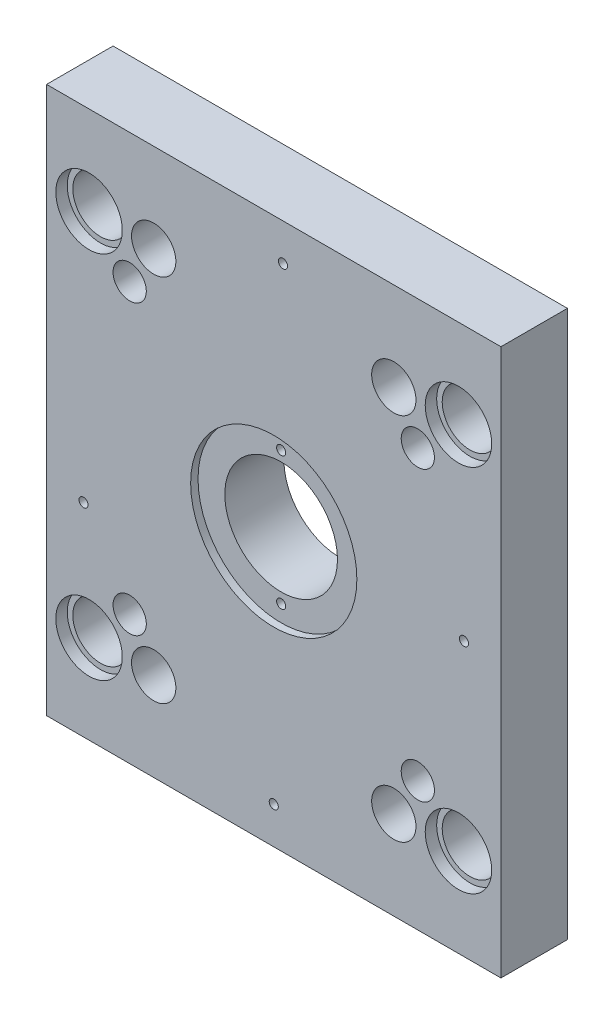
ISO-10303-21;
HEADER;
FILE_DESCRIPTION(('STEP AP214'),'2;1');
FILE_NAME('part.step','',(''),(''),'','','');
FILE_SCHEMA(('AUTOMOTIVE_DESIGN { 1 0 10303 214 1 1 1 1 }'));
ENDSEC;
DATA;
#1=APPLICATION_CONTEXT('core data for automotive mechanical design processes');
#2=APPLICATION_PROTOCOL_DEFINITION('international standard','automotive_design',2000,#1);
#3=PRODUCT_CONTEXT('',#1,'mechanical');
#4=PRODUCT('Part','Part','',(#3));
#5=PRODUCT_RELATED_PRODUCT_CATEGORY('part','',(#4));
#6=PRODUCT_DEFINITION_FORMATION('','',#4);
#7=PRODUCT_DEFINITION_CONTEXT('part definition',#1,'design');
#8=PRODUCT_DEFINITION('design','',#6,#7);
#9=PRODUCT_DEFINITION_SHAPE('','',#8);
#10=(LENGTH_UNIT() NAMED_UNIT(*) SI_UNIT(.MILLI.,.METRE.));
#11=(NAMED_UNIT(*) PLANE_ANGLE_UNIT() SI_UNIT($,.RADIAN.));
#12=(NAMED_UNIT(*) SI_UNIT($,.STERADIAN.) SOLID_ANGLE_UNIT());
#13=UNCERTAINTY_MEASURE_WITH_UNIT(LENGTH_MEASURE(1.E-05),#10,'distance_accuracy_value','');
#14=(GEOMETRIC_REPRESENTATION_CONTEXT(3) GLOBAL_UNCERTAINTY_ASSIGNED_CONTEXT((#13)) GLOBAL_UNIT_ASSIGNED_CONTEXT((#10,
#11,#12)) REPRESENTATION_CONTEXT('',''));
#15=CARTESIAN_POINT('',(0.,0.,0.));
#16=DIRECTION('',(0.,0.,1.));
#17=DIRECTION('',(1.,0.,0.));
#18=AXIS2_PLACEMENT_3D('',#15,#16,#17);
#19=CARTESIAN_POINT('',(0.,-36.,11.0000000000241));
#20=DIRECTION('',(0.,0.,1.));
#21=DIRECTION('',(1.,0.,0.));
#22=AXIS2_PLACEMENT_3D('',#19,#20,#21);
#23=CONICAL_SURFACE('',#22,2.45850000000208,1.04719755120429);
#24=CARTESIAN_POINT('',(0.,-36.,11.));
#25=DIRECTION('',(0.,0.,-1.));
#26=DIRECTION('',(-1.,0.,0.));
#27=AXIS2_PLACEMENT_3D('',#24,#25,#26);
#28=CIRCLE('',#27,2.4585);
#29=CARTESIAN_POINT('',(-2.45849999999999,-36.,11.));
#30=VERTEX_POINT('',#29);
#31=EDGE_CURVE('E180',#30,#30,#28,.F.);
#32=ORIENTED_EDGE('',*,*,#31,.T.);
#33=EDGE_LOOP('',(#32));
#34=FACE_BOUND('',#33,.T.);
#35=CARTESIAN_POINT('',(0.,-36.,9.58058436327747));
#36=VERTEX_POINT('',#35);
#37=VERTEX_LOOP('',#36);
#38=FACE_BOUND('',#37,.T.);
#39=ADVANCED_FACE('F16',(#34,#38),#23,.F.);
#40=CARTESIAN_POINT('',(0.,36.,11.0000000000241));
#41=DIRECTION('',(0.,0.,1.));
#42=DIRECTION('',(1.,0.,0.));
#43=AXIS2_PLACEMENT_3D('',#40,#41,#42);
#44=CONICAL_SURFACE('',#43,2.45850000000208,1.04719755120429);
#45=CARTESIAN_POINT('',(0.,36.,11.));
#46=DIRECTION('',(0.,0.,-1.));
#47=DIRECTION('',(-1.,0.,0.));
#48=AXIS2_PLACEMENT_3D('',#45,#46,#47);
#49=CIRCLE('',#48,2.4585);
#50=CARTESIAN_POINT('',(-2.4585,36.,11.));
#51=VERTEX_POINT('',#50);
#52=EDGE_CURVE('E177',#51,#51,#49,.F.);
#53=ORIENTED_EDGE('',*,*,#52,.T.);
#54=EDGE_LOOP('',(#53));
#55=FACE_BOUND('',#54,.T.);
#56=CARTESIAN_POINT('',(0.,36.0000000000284,9.58058436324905));
#57=VERTEX_POINT('',#56);
#58=VERTEX_LOOP('',#57);
#59=FACE_BOUND('',#58,.T.);
#60=ADVANCED_FACE('F70',(#55,#59),#44,.F.);
#61=CARTESIAN_POINT('',(5.,128.,7.99999999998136));
#62=DIRECTION('',(0.,0.,1.));
#63=DIRECTION('',(1.,0.,0.));
#64=AXIS2_PLACEMENT_3D('',#61,#62,#63);
#65=CONICAL_SURFACE('',#64,2.45849999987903,1.04719755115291);
#66=CARTESIAN_POINT('',(5.,128.,8.00000000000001));
#67=DIRECTION('',(0.,0.,-1.));
#68=DIRECTION('',(-1.,0.,0.));
#69=AXIS2_PLACEMENT_3D('',#66,#67,#68);
#70=CIRCLE('',#69,2.4585);
#71=CARTESIAN_POINT('',(2.5415,128.,8.00000000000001));
#72=VERTEX_POINT('',#71);
#73=EDGE_CURVE('E174',#72,#72,#70,.F.);
#74=ORIENTED_EDGE('',*,*,#73,.T.);
#75=EDGE_LOOP('',(#74));
#76=FACE_BOUND('',#75,.T.);
#77=CARTESIAN_POINT('',(4.99999999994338,128.000000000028,6.5805843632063));
#78=VERTEX_POINT('',#77);
#79=VERTEX_LOOP('',#78);
#80=FACE_BOUND('',#79,.T.);
#81=ADVANCED_FACE('F77',(#76,#80),#65,.F.);
#82=CARTESIAN_POINT('',(102.999999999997,1.46371630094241E-11,7.99999999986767));
#83=DIRECTION('',(0.,0.,1.));
#84=DIRECTION('',(1.,0.,0.));
#85=AXIS2_PLACEMENT_3D('',#82,#83,#84);
#86=CONICAL_SURFACE('',#85,2.45849999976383,1.04719755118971);
#87=CARTESIAN_POINT('',(102.999999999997,1.46371803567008E-11,8.00000000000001));
#88=DIRECTION('',(0.,0.,-1.));
#89=DIRECTION('',(-1.,0.,0.));
#90=AXIS2_PLACEMENT_3D('',#87,#88,#89);
#91=CIRCLE('',#90,2.4585);
#92=CARTESIAN_POINT('',(100.541499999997,1.46371803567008E-11,8.00000000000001));
#93=VERTEX_POINT('',#92);
#94=EDGE_CURVE('E171',#93,#93,#91,.F.);
#95=ORIENTED_EDGE('',*,*,#94,.T.);
#96=EDGE_LOOP('',(#95));
#97=FACE_BOUND('',#96,.T.);
#98=CARTESIAN_POINT('',(102.999999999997,1.46371666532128E-11,6.58058436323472));
#99=VERTEX_POINT('',#98);
#100=VERTEX_LOOP('',#99);
#101=FACE_BOUND('',#100,.T.);
#102=ADVANCED_FACE('F735',(#97,#101),#86,.F.);
#103=CARTESIAN_POINT('',(4.65317888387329E-12,-128.,7.99999999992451));
#104=DIRECTION('',(0.,0.,1.));
#105=DIRECTION('',(1.,0.,0.));
#106=AXIS2_PLACEMENT_3D('',#103,#104,#105);
#107=CONICAL_SURFACE('',#106,2.45849999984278,1.04719755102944);
#108=CARTESIAN_POINT('',(4.6531667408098E-12,-128.,8.00000000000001));
#109=DIRECTION('',(0.,0.,-1.));
#110=DIRECTION('',(-1.,0.,0.));
#111=AXIS2_PLACEMENT_3D('',#108,#109,#110);
#112=CIRCLE('',#111,2.4585);
#113=CARTESIAN_POINT('',(-2.45849999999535,-128.,8.00000000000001));
#114=VERTEX_POINT('',#113);
#115=EDGE_CURVE('E168',#114,#114,#112,.F.);
#116=ORIENTED_EDGE('',*,*,#115,.T.);
#117=EDGE_LOOP('',(#116));
#118=FACE_BOUND('',#117,.T.);
#119=CARTESIAN_POINT('',(-8.0611943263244E-11,-127.999999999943,6.58058436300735));
#120=VERTEX_POINT('',#119);
#121=VERTEX_LOOP('',#120);
#122=FACE_BOUND('',#121,.T.);
#123=ADVANCED_FACE('F727',(#118,#122),#107,.F.);
#124=CARTESIAN_POINT('',(-103.000000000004,-38.,7.99999999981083));
#125=DIRECTION('',(0.,0.,1.));
#126=DIRECTION('',(1.,0.,0.));
#127=AXIS2_PLACEMENT_3D('',#124,#125,#126);
#128=CONICAL_SURFACE('',#127,2.45849999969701,1.047197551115);
#129=CARTESIAN_POINT('',(-103.000000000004,-38.,7.99999999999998));
#130=DIRECTION('',(0.,0.,-1.));
#131=DIRECTION('',(-1.,0.,0.));
#132=AXIS2_PLACEMENT_3D('',#129,#130,#131);
#133=CIRCLE('',#132,2.4585);
#134=CARTESIAN_POINT('',(-105.458500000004,-38.,7.99999999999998));
#135=VERTEX_POINT('',#134);
#136=EDGE_CURVE('E165',#135,#135,#133,.F.);
#137=ORIENTED_EDGE('',*,*,#136,.T.);
#138=EDGE_LOOP('',(#137));
#139=FACE_BOUND('',#138,.T.);
#140=CARTESIAN_POINT('',(-103.00000000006,-37.9999999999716,6.58058436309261));
#141=VERTEX_POINT('',#140);
#142=VERTEX_LOOP('',#141);
#143=FACE_BOUND('',#142,.T.);
#144=ADVANCED_FACE('F719',(#139,#143),#128,.F.);
#145=CARTESIAN_POINT('',(-80.0000000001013,0.,18.));
#146=DIRECTION('',(-1.,0.,0.));
#147=DIRECTION('',(0.,0.,1.));
#148=AXIS2_PLACEMENT_3D('',#145,#146,#147);
#149=CONICAL_SURFACE('',#148,5.9175000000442,1.04719755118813);
#150=CARTESIAN_POINT('',(-80.0000000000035,0.,18.));
#151=DIRECTION('',(1.,0.,0.));
#152=DIRECTION('',(0.,0.,-1.));
#153=AXIS2_PLACEMENT_3D('',#150,#151,#152);
#154=CIRCLE('',#153,5.9175);
#155=CARTESIAN_POINT('',(-80.0000000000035,0.,12.0825));
#156=VERTEX_POINT('',#155);
#157=EDGE_CURVE('E162',#156,#156,#154,.F.);
#158=ORIENTED_EDGE('',*,*,#157,.T.);
#159=EDGE_LOOP('',(#158));
#160=FACE_BOUND('',#159,.T.);
#161=CARTESIAN_POINT('',(-76.5835297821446,5.68434091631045E-11,18.0000000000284));
#162=VERTEX_POINT('',#161);
#163=VERTEX_LOOP('',#162);
#164=FACE_BOUND('',#163,.T.);
#165=ADVANCED_FACE('F712',(#160,#164),#149,.F.);
#166=CARTESIAN_POINT('',(0.,-36.,31.9));
#167=DIRECTION('',(0.,0.,-1.));
#168=DIRECTION('',(-1.,0.,0.));
#169=AXIS2_PLACEMENT_3D('',#166,#167,#168);
#170=CYLINDRICAL_SURFACE('',#169,2.4585);
#171=ORIENTED_EDGE('',*,*,#31,.F.);
#172=EDGE_LOOP('',(#171));
#173=FACE_BOUND('',#172,.T.);
#174=CARTESIAN_POINT('',(0.,-36.,32.));
#175=DIRECTION('',(0.,0.,-1.));
#176=DIRECTION('',(-1.,0.,0.));
#177=AXIS2_PLACEMENT_3D('',#174,#175,#176);
#178=CIRCLE('',#177,2.4585);
#179=CARTESIAN_POINT('',(-2.45849999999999,-36.,32.));
#180=VERTEX_POINT('',#179);
#181=EDGE_CURVE('E288',#180,#180,#178,.T.);
#182=ORIENTED_EDGE('',*,*,#181,.F.);
#183=EDGE_LOOP('',(#182));
#184=FACE_BOUND('',#183,.T.);
#185=ADVANCED_FACE('F493',(#173,#184),#170,.F.);
#186=CARTESIAN_POINT('',(0.,36.,31.9));
#187=DIRECTION('',(0.,0.,-1.));
#188=DIRECTION('',(-1.,0.,0.));
#189=AXIS2_PLACEMENT_3D('',#186,#187,#188);
#190=CYLINDRICAL_SURFACE('',#189,2.4585);
#191=ORIENTED_EDGE('',*,*,#52,.F.);
#192=EDGE_LOOP('',(#191));
#193=FACE_BOUND('',#192,.T.);
#194=CARTESIAN_POINT('',(0.,36.,32.));
#195=DIRECTION('',(0.,0.,-1.));
#196=DIRECTION('',(-1.,0.,0.));
#197=AXIS2_PLACEMENT_3D('',#194,#195,#196);
#198=CIRCLE('',#197,2.4585);
#199=CARTESIAN_POINT('',(-2.4585,36.,32.));
#200=VERTEX_POINT('',#199);
#201=EDGE_CURVE('E285',#200,#200,#198,.T.);
#202=ORIENTED_EDGE('',*,*,#201,.F.);
#203=EDGE_LOOP('',(#202));
#204=FACE_BOUND('',#203,.T.);
#205=ADVANCED_FACE('F484',(#193,#204),#190,.F.);
#206=CARTESIAN_POINT('',(5.,128.,35.9));
#207=DIRECTION('',(0.,0.,-1.));
#208=DIRECTION('',(-1.,0.,0.));
#209=AXIS2_PLACEMENT_3D('',#206,#207,#208);
#210=CYLINDRICAL_SURFACE('',#209,2.4585);
#211=ORIENTED_EDGE('',*,*,#73,.F.);
#212=EDGE_LOOP('',(#211));
#213=FACE_BOUND('',#212,.T.);
#214=CARTESIAN_POINT('',(5.,128.,36.));
#215=DIRECTION('',(0.,0.,-1.));
#216=DIRECTION('',(-1.,0.,0.));
#217=AXIS2_PLACEMENT_3D('',#214,#215,#216);
#218=CIRCLE('',#217,2.4585);
#219=CARTESIAN_POINT('',(2.5415,128.,36.));
#220=VERTEX_POINT('',#219);
#221=EDGE_CURVE('E282',#220,#220,#218,.T.);
#222=ORIENTED_EDGE('',*,*,#221,.F.);
#223=EDGE_LOOP('',(#222));
#224=FACE_BOUND('',#223,.T.);
#225=ADVANCED_FACE('F482',(#213,#224),#210,.F.);
#226=CARTESIAN_POINT('',(100.,-100.,35.9));
#227=DIRECTION('',(0.,0.,-1.));
#228=DIRECTION('',(-1.,0.,0.));
#229=AXIS2_PLACEMENT_3D('',#226,#227,#228);
#230=CYLINDRICAL_SURFACE('',#229,18.);
#231=CARTESIAN_POINT('',(99.9999999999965,-100.,29.8));
#232=DIRECTION('',(0.,0.,-1.));
#233=DIRECTION('',(-1.,0.,0.));
#234=AXIS2_PLACEMENT_3D('',#231,#232,#233);
#235=CIRCLE('',#234,18.);
#236=CARTESIAN_POINT('',(81.9999999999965,-100.,29.8));
#237=VERTEX_POINT('',#236);
#238=EDGE_CURVE('E20',#237,#237,#235,.T.);
#239=ORIENTED_EDGE('',*,*,#238,.T.);
#240=EDGE_LOOP('',(#239));
#241=FACE_BOUND('',#240,.T.);
#242=CARTESIAN_POINT('',(100.,-100.,36.));
#243=DIRECTION('',(0.,0.,-1.));
#244=DIRECTION('',(-1.,0.,0.));
#245=AXIS2_PLACEMENT_3D('',#242,#243,#244);
#246=CIRCLE('',#245,18.);
#247=CARTESIAN_POINT('',(82.,-100.,36.));
#248=VERTEX_POINT('',#247);
#249=EDGE_CURVE('E279',#248,#248,#246,.T.);
#250=ORIENTED_EDGE('',*,*,#249,.F.);
#251=EDGE_LOOP('',(#250));
#252=FACE_BOUND('',#251,.T.);
#253=ADVANCED_FACE('F309',(#241,#252),#230,.F.);
#254=CARTESIAN_POINT('',(65.,100.,35.9));
#255=DIRECTION('',(0.,0.,-1.));
#256=DIRECTION('',(-1.,0.,0.));
#257=AXIS2_PLACEMENT_3D('',#254,#255,#256);
#258=CYLINDRICAL_SURFACE('',#257,12.);
#259=CARTESIAN_POINT('',(64.9999999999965,100.,15.));
#260=DIRECTION('',(0.,0.,-1.));
#261=DIRECTION('',(-1.,0.,0.));
#262=AXIS2_PLACEMENT_3D('',#259,#260,#261);
#263=CIRCLE('',#262,12.);
#264=CARTESIAN_POINT('',(52.9999999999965,100.,15.));
#265=VERTEX_POINT('',#264);
#266=EDGE_CURVE('E302',#265,#265,#263,.T.);
#267=ORIENTED_EDGE('',*,*,#266,.T.);
#268=EDGE_LOOP('',(#267));
#269=FACE_BOUND('',#268,.T.);
#270=CARTESIAN_POINT('',(65.,100.,36.));
#271=DIRECTION('',(0.,0.,-1.));
#272=DIRECTION('',(-1.,0.,0.));
#273=AXIS2_PLACEMENT_3D('',#270,#271,#272);
#274=CIRCLE('',#273,12.);
#275=CARTESIAN_POINT('',(53.,100.,36.));
#276=VERTEX_POINT('',#275);
#277=EDGE_CURVE('E276',#276,#276,#274,.T.);
#278=ORIENTED_EDGE('',*,*,#277,.F.);
#279=EDGE_LOOP('',(#278));
#280=FACE_BOUND('',#279,.T.);
#281=ADVANCED_FACE('F491',(#269,#280),#258,.F.);
#282=CARTESIAN_POINT('',(-65.,100.,35.9));
#283=DIRECTION('',(0.,0.,-1.));
#284=DIRECTION('',(-1.,0.,0.));
#285=AXIS2_PLACEMENT_3D('',#282,#283,#284);
#286=CYLINDRICAL_SURFACE('',#285,12.);
#287=CARTESIAN_POINT('',(-65.0000000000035,100.,15.));
#288=DIRECTION('',(0.,0.,-1.));
#289=DIRECTION('',(-1.,0.,0.));
#290=AXIS2_PLACEMENT_3D('',#287,#288,#289);
#291=CIRCLE('',#290,12.);
#292=CARTESIAN_POINT('',(-77.0000000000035,100.,15.));
#293=VERTEX_POINT('',#292);
#294=EDGE_CURVE('E300',#293,#293,#291,.T.);
#295=ORIENTED_EDGE('',*,*,#294,.T.);
#296=EDGE_LOOP('',(#295));
#297=FACE_BOUND('',#296,.T.);
#298=CARTESIAN_POINT('',(-65.,100.,36.));
#299=DIRECTION('',(0.,0.,-1.));
#300=DIRECTION('',(-1.,0.,0.));
#301=AXIS2_PLACEMENT_3D('',#298,#299,#300);
#302=CIRCLE('',#301,12.);
#303=CARTESIAN_POINT('',(-77.,100.,36.));
#304=VERTEX_POINT('',#303);
#305=EDGE_CURVE('E273',#304,#304,#302,.T.);
#306=ORIENTED_EDGE('',*,*,#305,.F.);
#307=EDGE_LOOP('',(#306));
#308=FACE_BOUND('',#307,.T.);
#309=ADVANCED_FACE('F501',(#297,#308),#286,.F.);
#310=CARTESIAN_POINT('',(-65.,-100.,35.9));
#311=DIRECTION('',(0.,0.,-1.));
#312=DIRECTION('',(-1.,0.,0.));
#313=AXIS2_PLACEMENT_3D('',#310,#311,#312);
#314=CYLINDRICAL_SURFACE('',#313,12.);
#315=CARTESIAN_POINT('',(-65.0000000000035,-100.,15.));
#316=DIRECTION('',(0.,0.,-1.));
#317=DIRECTION('',(-1.,0.,0.));
#318=AXIS2_PLACEMENT_3D('',#315,#316,#317);
#319=CIRCLE('',#318,12.);
#320=CARTESIAN_POINT('',(-77.0000000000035,-100.,15.));
#321=VERTEX_POINT('',#320);
#322=EDGE_CURVE('E297',#321,#321,#319,.T.);
#323=ORIENTED_EDGE('',*,*,#322,.T.);
#324=EDGE_LOOP('',(#323));
#325=FACE_BOUND('',#324,.T.);
#326=CARTESIAN_POINT('',(-65.,-100.,36.));
#327=DIRECTION('',(0.,0.,-1.));
#328=DIRECTION('',(-1.,0.,0.));
#329=AXIS2_PLACEMENT_3D('',#326,#327,#328);
#330=CIRCLE('',#329,12.);
#331=CARTESIAN_POINT('',(-77.,-100.,36.));
#332=VERTEX_POINT('',#331);
#333=EDGE_CURVE('E270',#332,#332,#330,.T.);
#334=ORIENTED_EDGE('',*,*,#333,.F.);
#335=EDGE_LOOP('',(#334));
#336=FACE_BOUND('',#335,.T.);
#337=ADVANCED_FACE('F504',(#325,#336),#314,.F.);
#338=CARTESIAN_POINT('',(65.,-100.,35.9));
#339=DIRECTION('',(0.,0.,-1.));
#340=DIRECTION('',(-1.,0.,0.));
#341=AXIS2_PLACEMENT_3D('',#338,#339,#340);
#342=CYLINDRICAL_SURFACE('',#341,12.);
#343=CARTESIAN_POINT('',(64.9999999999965,-100.,15.));
#344=DIRECTION('',(0.,0.,-1.));
#345=DIRECTION('',(-1.,0.,0.));
#346=AXIS2_PLACEMENT_3D('',#343,#344,#345);
#347=CIRCLE('',#346,12.);
#348=CARTESIAN_POINT('',(52.9999999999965,-100.,15.));
#349=VERTEX_POINT('',#348);
#350=EDGE_CURVE('E294',#349,#349,#347,.T.);
#351=ORIENTED_EDGE('',*,*,#350,.T.);
#352=EDGE_LOOP('',(#351));
#353=FACE_BOUND('',#352,.T.);
#354=CARTESIAN_POINT('',(65.,-100.,36.));
#355=DIRECTION('',(0.,0.,-1.));
#356=DIRECTION('',(-1.,0.,0.));
#357=AXIS2_PLACEMENT_3D('',#354,#355,#356);
#358=CIRCLE('',#357,12.);
#359=CARTESIAN_POINT('',(53.,-100.,36.));
#360=VERTEX_POINT('',#359);
#361=EDGE_CURVE('E267',#360,#360,#358,.T.);
#362=ORIENTED_EDGE('',*,*,#361,.F.);
#363=EDGE_LOOP('',(#362));
#364=FACE_BOUND('',#363,.T.);
#365=ADVANCED_FACE('F508',(#353,#364),#342,.F.);
#366=CARTESIAN_POINT('',(0.,0.,34.));
#367=DIRECTION('',(0.,0.,1.));
#368=DIRECTION('',(1.,0.,0.));
#369=AXIS2_PLACEMENT_3D('',#366,#367,#368);
#370=CYLINDRICAL_SURFACE('',#369,45.);
#371=CARTESIAN_POINT('',(0.,0.,36.));
#372=DIRECTION('',(0.,0.,1.));
#373=DIRECTION('',(1.,0.,0.));
#374=AXIS2_PLACEMENT_3D('',#371,#372,#373);
#375=CIRCLE('',#374,45.);
#376=CARTESIAN_POINT('',(45.,0.,36.));
#377=VERTEX_POINT('',#376);
#378=EDGE_CURVE('E264',#377,#377,#375,.F.);
#379=ORIENTED_EDGE('',*,*,#378,.F.);
#380=EDGE_LOOP('',(#379));
#381=FACE_BOUND('',#380,.T.);
#382=CARTESIAN_POINT('',(0.,0.,32.));
#383=DIRECTION('',(0.,0.,1.));
#384=DIRECTION('',(1.,0.,0.));
#385=AXIS2_PLACEMENT_3D('',#382,#383,#384);
#386=CIRCLE('',#385,45.);
#387=CARTESIAN_POINT('',(45.,0.,32.));
#388=VERTEX_POINT('',#387);
#389=EDGE_CURVE('E291',#388,#388,#386,.T.);
#390=ORIENTED_EDGE('',*,*,#389,.F.);
#391=EDGE_LOOP('',(#390));
#392=FACE_BOUND('',#391,.T.);
#393=ADVANCED_FACE('F512',(#381,#392),#370,.F.);
#394=CARTESIAN_POINT('',(103.,1.46371803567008E-11,35.9));
#395=DIRECTION('',(0.,0.,-1.));
#396=DIRECTION('',(-1.,0.,0.));
#397=AXIS2_PLACEMENT_3D('',#394,#395,#396);
#398=CYLINDRICAL_SURFACE('',#397,2.4585);
#399=ORIENTED_EDGE('',*,*,#94,.F.);
#400=EDGE_LOOP('',(#399));
#401=FACE_BOUND('',#400,.T.);
#402=CARTESIAN_POINT('',(103.,1.46371803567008E-11,36.));
#403=DIRECTION('',(0.,0.,-1.));
#404=DIRECTION('',(-1.,0.,0.));
#405=AXIS2_PLACEMENT_3D('',#402,#403,#404);
#406=CIRCLE('',#405,2.4585);
#407=CARTESIAN_POINT('',(100.5415,1.46371803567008E-11,36.));
#408=VERTEX_POINT('',#407);
#409=EDGE_CURVE('E252',#408,#408,#406,.T.);
#410=ORIENTED_EDGE('',*,*,#409,.F.);
#411=EDGE_LOOP('',(#410));
#412=FACE_BOUND('',#411,.T.);
#413=ADVANCED_FACE('F516',(#401,#412),#398,.F.);
#414=CARTESIAN_POINT('',(4.6531667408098E-12,-128.,35.9));
#415=DIRECTION('',(0.,0.,-1.));
#416=DIRECTION('',(-1.,0.,0.));
#417=AXIS2_PLACEMENT_3D('',#414,#415,#416);
#418=CYLINDRICAL_SURFACE('',#417,2.4585);
#419=ORIENTED_EDGE('',*,*,#115,.F.);
#420=EDGE_LOOP('',(#419));
#421=FACE_BOUND('',#420,.T.);
#422=CARTESIAN_POINT('',(4.65316674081E-12,-128.,36.));
#423=DIRECTION('',(0.,0.,-1.));
#424=DIRECTION('',(-1.,0.,0.));
#425=AXIS2_PLACEMENT_3D('',#422,#423,#424);
#426=CIRCLE('',#425,2.4585);
#427=CARTESIAN_POINT('',(-2.45849999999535,-128.,36.));
#428=VERTEX_POINT('',#427);
#429=EDGE_CURVE('E249',#428,#428,#426,.T.);
#430=ORIENTED_EDGE('',*,*,#429,.F.);
#431=EDGE_LOOP('',(#430));
#432=FACE_BOUND('',#431,.T.);
#433=ADVANCED_FACE('F520',(#421,#432),#418,.F.);
#434=CARTESIAN_POINT('',(-103.000000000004,-38.,35.9));
#435=DIRECTION('',(0.,0.,-1.));
#436=DIRECTION('',(-1.,0.,0.));
#437=AXIS2_PLACEMENT_3D('',#434,#435,#436);
#438=CYLINDRICAL_SURFACE('',#437,2.4585);
#439=ORIENTED_EDGE('',*,*,#136,.F.);
#440=EDGE_LOOP('',(#439));
#441=FACE_BOUND('',#440,.T.);
#442=CARTESIAN_POINT('',(-103.000000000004,-38.,36.));
#443=DIRECTION('',(0.,0.,-1.));
#444=DIRECTION('',(-1.,0.,0.));
#445=AXIS2_PLACEMENT_3D('',#442,#443,#444);
#446=CIRCLE('',#445,2.4585);
#447=CARTESIAN_POINT('',(-105.458500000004,-38.,36.));
#448=VERTEX_POINT('',#447);
#449=EDGE_CURVE('E246',#448,#448,#446,.T.);
#450=ORIENTED_EDGE('',*,*,#449,.F.);
#451=EDGE_LOOP('',(#450));
#452=FACE_BOUND('',#451,.T.);
#453=ADVANCED_FACE('F524',(#441,#452),#438,.F.);
#454=CARTESIAN_POINT('',(-100.,-100.,35.9));
#455=DIRECTION('',(0.,0.,-1.));
#456=DIRECTION('',(-1.,0.,0.));
#457=AXIS2_PLACEMENT_3D('',#454,#455,#456);
#458=CYLINDRICAL_SURFACE('',#457,18.);
#459=CARTESIAN_POINT('',(-100.000000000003,-100.,29.8));
#460=DIRECTION('',(0.,0.,-1.));
#461=DIRECTION('',(-1.,0.,0.));
#462=AXIS2_PLACEMENT_3D('',#459,#460,#461);
#463=CIRCLE('',#462,18.);
#464=CARTESIAN_POINT('',(-118.000000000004,-100.,29.8));
#465=VERTEX_POINT('',#464);
#466=EDGE_CURVE('E243',#465,#465,#463,.T.);
#467=ORIENTED_EDGE('',*,*,#466,.T.);
#468=EDGE_LOOP('',(#467));
#469=FACE_BOUND('',#468,.T.);
#470=CARTESIAN_POINT('',(-100.,-100.,36.));
#471=DIRECTION('',(0.,0.,-1.));
#472=DIRECTION('',(-1.,0.,0.));
#473=AXIS2_PLACEMENT_3D('',#470,#471,#472);
#474=CIRCLE('',#473,18.);
#475=CARTESIAN_POINT('',(-118.,-100.,36.));
#476=VERTEX_POINT('',#475);
#477=EDGE_CURVE('E261',#476,#476,#474,.T.);
#478=ORIENTED_EDGE('',*,*,#477,.F.);
#479=EDGE_LOOP('',(#478));
#480=FACE_BOUND('',#479,.T.);
#481=ADVANCED_FACE('F430',(#469,#480),#458,.F.);
#482=CARTESIAN_POINT('',(-100.,100.,35.9));
#483=DIRECTION('',(0.,0.,-1.));
#484=DIRECTION('',(-1.,0.,0.));
#485=AXIS2_PLACEMENT_3D('',#482,#483,#484);
#486=CYLINDRICAL_SURFACE('',#485,18.);
#487=CARTESIAN_POINT('',(-100.000000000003,100.,29.8));
#488=DIRECTION('',(0.,0.,-1.));
#489=DIRECTION('',(-1.,0.,0.));
#490=AXIS2_PLACEMENT_3D('',#487,#488,#489);
#491=CIRCLE('',#490,18.);
#492=CARTESIAN_POINT('',(-118.000000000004,100.,29.8));
#493=VERTEX_POINT('',#492);
#494=EDGE_CURVE('E240',#493,#493,#491,.T.);
#495=ORIENTED_EDGE('',*,*,#494,.T.);
#496=EDGE_LOOP('',(#495));
#497=FACE_BOUND('',#496,.T.);
#498=CARTESIAN_POINT('',(-100.,100.,36.));
#499=DIRECTION('',(0.,0.,-1.));
#500=DIRECTION('',(-1.,0.,0.));
#501=AXIS2_PLACEMENT_3D('',#498,#499,#500);
#502=CIRCLE('',#501,18.);
#503=CARTESIAN_POINT('',(-118.,100.,36.));
#504=VERTEX_POINT('',#503);
#505=EDGE_CURVE('E258',#504,#504,#502,.T.);
#506=ORIENTED_EDGE('',*,*,#505,.F.);
#507=EDGE_LOOP('',(#506));
#508=FACE_BOUND('',#507,.T.);
#509=ADVANCED_FACE('F427',(#497,#508),#486,.F.);
#510=CARTESIAN_POINT('',(100.,100.,35.9));
#511=DIRECTION('',(0.,0.,-1.));
#512=DIRECTION('',(-1.,0.,0.));
#513=AXIS2_PLACEMENT_3D('',#510,#511,#512);
#514=CYLINDRICAL_SURFACE('',#513,18.);
#515=CARTESIAN_POINT('',(99.9999999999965,100.,29.8));
#516=DIRECTION('',(0.,0.,-1.));
#517=DIRECTION('',(-1.,0.,0.));
#518=AXIS2_PLACEMENT_3D('',#515,#516,#517);
#519=CIRCLE('',#518,18.);
#520=CARTESIAN_POINT('',(81.9999999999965,100.,29.8));
#521=VERTEX_POINT('',#520);
#522=EDGE_CURVE('E236',#521,#521,#519,.T.);
#523=ORIENTED_EDGE('',*,*,#522,.T.);
#524=EDGE_LOOP('',(#523));
#525=FACE_BOUND('',#524,.T.);
#526=CARTESIAN_POINT('',(100.,100.,36.));
#527=DIRECTION('',(0.,0.,-1.));
#528=DIRECTION('',(-1.,0.,0.));
#529=AXIS2_PLACEMENT_3D('',#526,#527,#528);
#530=CIRCLE('',#529,18.);
#531=CARTESIAN_POINT('',(82.,100.,36.));
#532=VERTEX_POINT('',#531);
#533=EDGE_CURVE('E255',#532,#532,#530,.T.);
#534=ORIENTED_EDGE('',*,*,#533,.F.);
#535=EDGE_LOOP('',(#534));
#536=FACE_BOUND('',#535,.T.);
#537=ADVANCED_FACE('F325',(#525,#536),#514,.F.);
#538=CARTESIAN_POINT('',(-122.900000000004,0.,18.));
#539=DIRECTION('',(1.,0.,0.));
#540=DIRECTION('',(0.,0.,-1.));
#541=AXIS2_PLACEMENT_3D('',#538,#539,#540);
#542=CYLINDRICAL_SURFACE('',#541,5.9175);
#543=ORIENTED_EDGE('',*,*,#157,.F.);
#544=EDGE_LOOP('',(#543));
#545=FACE_BOUND('',#544,.T.);
#546=CARTESIAN_POINT('',(-123.000000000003,0.,18.));
#547=DIRECTION('',(1.,0.,0.));
#548=DIRECTION('',(0.,0.,-1.));
#549=AXIS2_PLACEMENT_3D('',#546,#547,#548);
#550=CIRCLE('',#549,5.9175);
#551=CARTESIAN_POINT('',(-123.000000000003,0.,12.0825));
#552=VERTEX_POINT('',#551);
#553=EDGE_CURVE('E232',#552,#552,#550,.F.);
#554=ORIENTED_EDGE('',*,*,#553,.T.);
#555=EDGE_LOOP('',(#554));
#556=FACE_BOUND('',#555,.T.);
#557=ADVANCED_FACE('F315',(#545,#556),#542,.F.);
#558=CARTESIAN_POINT('',(99.9999999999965,-115.,29.8));
#559=DIRECTION('',(0.,0.,-1.));
#560=DIRECTION('',(-1.,0.,0.));
#561=AXIS2_PLACEMENT_3D('',#558,#559,#560);
#562=PLANE('',#561);
#563=CARTESIAN_POINT('',(99.9999999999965,-100.,29.8));
#564=DIRECTION('',(0.,0.,-1.));
#565=DIRECTION('',(-1.,0.,0.));
#566=AXIS2_PLACEMENT_3D('',#563,#564,#565);
#567=CIRCLE('',#566,15.);
#568=CARTESIAN_POINT('',(84.9999999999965,-100.,29.8));
#569=VERTEX_POINT('',#568);
#570=EDGE_CURVE('E229',#569,#569,#567,.T.);
#571=ORIENTED_EDGE('',*,*,#570,.T.);
#572=EDGE_LOOP('',(#571));
#573=FACE_BOUND('',#572,.T.);
#574=ORIENTED_EDGE('',*,*,#238,.F.);
#575=EDGE_LOOP('',(#574));
#576=FACE_BOUND('',#575,.T.);
#577=ADVANCED_FACE('F312',(#573,#576),#562,.F.);
#578=CARTESIAN_POINT('',(64.9999999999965,-108.5,15.));
#579=DIRECTION('',(0.,0.,-1.));
#580=DIRECTION('',(-1.,0.,0.));
#581=AXIS2_PLACEMENT_3D('',#578,#579,#580);
#582=PLANE('',#581);
#583=CARTESIAN_POINT('',(64.9999999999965,100.,15.));
#584=DIRECTION('',(0.,0.,-1.));
#585=DIRECTION('',(-1.,0.,0.));
#586=AXIS2_PLACEMENT_3D('',#583,#584,#585);
#587=CIRCLE('',#586,8.5);
#588=CARTESIAN_POINT('',(56.4999999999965,100.,15.));
#589=VERTEX_POINT('',#588);
#590=EDGE_CURVE('E226',#589,#589,#587,.T.);
#591=ORIENTED_EDGE('',*,*,#590,.T.);
#592=EDGE_LOOP('',(#591));
#593=FACE_BOUND('',#592,.T.);
#594=ORIENTED_EDGE('',*,*,#266,.F.);
#595=EDGE_LOOP('',(#594));
#596=FACE_BOUND('',#595,.T.);
#597=ADVANCED_FACE('F314',(#593,#596),#582,.F.);
#598=CARTESIAN_POINT('',(64.9999999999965,-108.5,15.));
#599=DIRECTION('',(0.,0.,-1.));
#600=DIRECTION('',(-1.,0.,0.));
#601=AXIS2_PLACEMENT_3D('',#598,#599,#600);
#602=PLANE('',#601);
#603=CARTESIAN_POINT('',(-65.0000000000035,100.,15.));
#604=DIRECTION('',(0.,0.,-1.));
#605=DIRECTION('',(-1.,0.,0.));
#606=AXIS2_PLACEMENT_3D('',#603,#604,#605);
#607=CIRCLE('',#606,8.5);
#608=CARTESIAN_POINT('',(-73.5000000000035,100.,15.));
#609=VERTEX_POINT('',#608);
#610=EDGE_CURVE('E223',#609,#609,#607,.T.);
#611=ORIENTED_EDGE('',*,*,#610,.T.);
#612=EDGE_LOOP('',(#611));
#613=FACE_BOUND('',#612,.T.);
#614=ORIENTED_EDGE('',*,*,#294,.F.);
#615=EDGE_LOOP('',(#614));
#616=FACE_BOUND('',#615,.T.);
#617=ADVANCED_FACE('F322',(#613,#616),#602,.F.);
#618=CARTESIAN_POINT('',(64.9999999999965,-108.5,15.));
#619=DIRECTION('',(0.,0.,-1.));
#620=DIRECTION('',(-1.,0.,0.));
#621=AXIS2_PLACEMENT_3D('',#618,#619,#620);
#622=PLANE('',#621);
#623=CARTESIAN_POINT('',(-65.0000000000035,-100.,15.));
#624=DIRECTION('',(0.,0.,-1.));
#625=DIRECTION('',(-1.,0.,0.));
#626=AXIS2_PLACEMENT_3D('',#623,#624,#625);
#627=CIRCLE('',#626,8.5);
#628=CARTESIAN_POINT('',(-73.5000000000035,-100.,15.));
#629=VERTEX_POINT('',#628);
#630=EDGE_CURVE('E220',#629,#629,#627,.T.);
#631=ORIENTED_EDGE('',*,*,#630,.T.);
#632=EDGE_LOOP('',(#631));
#633=FACE_BOUND('',#632,.T.);
#634=ORIENTED_EDGE('',*,*,#322,.F.);
#635=EDGE_LOOP('',(#634));
#636=FACE_BOUND('',#635,.T.);
#637=ADVANCED_FACE('F332',(#633,#636),#622,.F.);
#638=CARTESIAN_POINT('',(64.9999999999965,-108.5,15.));
#639=DIRECTION('',(0.,0.,-1.));
#640=DIRECTION('',(-1.,0.,0.));
#641=AXIS2_PLACEMENT_3D('',#638,#639,#640);
#642=PLANE('',#641);
#643=CARTESIAN_POINT('',(64.9999999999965,-100.,15.));
#644=DIRECTION('',(0.,0.,-1.));
#645=DIRECTION('',(-1.,0.,0.));
#646=AXIS2_PLACEMENT_3D('',#643,#644,#645);
#647=CIRCLE('',#646,8.5);
#648=CARTESIAN_POINT('',(56.4999999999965,-100.,15.));
#649=VERTEX_POINT('',#648);
#650=EDGE_CURVE('E217',#649,#649,#647,.T.);
#651=ORIENTED_EDGE('',*,*,#650,.T.);
#652=EDGE_LOOP('',(#651));
#653=FACE_BOUND('',#652,.T.);
#654=ORIENTED_EDGE('',*,*,#350,.F.);
#655=EDGE_LOOP('',(#654));
#656=FACE_BOUND('',#655,.T.);
#657=ADVANCED_FACE('F336',(#653,#656),#642,.F.);
#658=CARTESIAN_POINT('',(0.,0.,32.));
#659=DIRECTION('',(0.,0.,1.));
#660=DIRECTION('',(1.,0.,0.));
#661=AXIS2_PLACEMENT_3D('',#658,#659,#660);
#662=PLANE('',#661);
#663=CARTESIAN_POINT('',(0.,0.,32.));
#664=DIRECTION('',(0.,0.,1.));
#665=DIRECTION('',(1.,0.,0.));
#666=AXIS2_PLACEMENT_3D('',#663,#664,#665);
#667=CIRCLE('',#666,30.5);
#668=CARTESIAN_POINT('',(30.5,0.,32.));
#669=VERTEX_POINT('',#668);
#670=EDGE_CURVE('E211',#669,#669,#667,.F.);
#671=ORIENTED_EDGE('',*,*,#670,.T.);
#672=EDGE_LOOP('',(#671));
#673=FACE_BOUND('',#672,.T.);
#674=ORIENTED_EDGE('',*,*,#201,.T.);
#675=EDGE_LOOP('',(#674));
#676=FACE_BOUND('',#675,.T.);
#677=ORIENTED_EDGE('',*,*,#181,.T.);
#678=EDGE_LOOP('',(#677));
#679=FACE_BOUND('',#678,.T.);
#680=ORIENTED_EDGE('',*,*,#389,.T.);
#681=EDGE_LOOP('',(#680));
#682=FACE_BOUND('',#681,.T.);
#683=ADVANCED_FACE('F340',(#673,#676,#679,#682),#662,.T.);
#684=CARTESIAN_POINT('',(0.,0.,36.));
#685=DIRECTION('',(0.,0.,1.));
#686=DIRECTION('',(1.,0.,0.));
#687=AXIS2_PLACEMENT_3D('',#684,#685,#686);
#688=PLANE('',#687);
#689=ORIENTED_EDGE('',*,*,#449,.T.);
#690=EDGE_LOOP('',(#689));
#691=FACE_BOUND('',#690,.T.);
#692=ORIENTED_EDGE('',*,*,#429,.T.);
#693=EDGE_LOOP('',(#692));
#694=FACE_BOUND('',#693,.T.);
#695=ORIENTED_EDGE('',*,*,#409,.T.);
#696=EDGE_LOOP('',(#695));
#697=FACE_BOUND('',#696,.T.);
#698=ORIENTED_EDGE('',*,*,#533,.T.);
#699=EDGE_LOOP('',(#698));
#700=FACE_BOUND('',#699,.T.);
#701=ORIENTED_EDGE('',*,*,#505,.T.);
#702=EDGE_LOOP('',(#701));
#703=FACE_BOUND('',#702,.T.);
#704=ORIENTED_EDGE('',*,*,#477,.T.);
#705=EDGE_LOOP('',(#704));
#706=FACE_BOUND('',#705,.T.);
#707=CARTESIAN_POINT('',(77.9999999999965,78.,36.));
#708=DIRECTION('',(0.,0.,-1.));
#709=DIRECTION('',(-1.,0.,0.));
#710=AXIS2_PLACEMENT_3D('',#707,#708,#709);
#711=CIRCLE('',#710,9.);
#712=CARTESIAN_POINT('',(68.9999999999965,78.,36.));
#713=VERTEX_POINT('',#712);
#714=EDGE_CURVE('E202',#713,#713,#711,.T.);
#715=ORIENTED_EDGE('',*,*,#714,.T.);
#716=EDGE_LOOP('',(#715));
#717=FACE_BOUND('',#716,.T.);
#718=CARTESIAN_POINT('',(-78.0000000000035,78.,36.));
#719=DIRECTION('',(0.,0.,-1.));
#720=DIRECTION('',(-1.,0.,0.));
#721=AXIS2_PLACEMENT_3D('',#718,#719,#720);
#722=CIRCLE('',#721,9.);
#723=CARTESIAN_POINT('',(-87.0000000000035,78.,36.));
#724=VERTEX_POINT('',#723);
#725=EDGE_CURVE('E205',#724,#724,#722,.T.);
#726=ORIENTED_EDGE('',*,*,#725,.T.);
#727=EDGE_LOOP('',(#726));
#728=FACE_BOUND('',#727,.T.);
#729=CARTESIAN_POINT('',(-78.,-78.,36.));
#730=DIRECTION('',(0.,0.,-1.));
#731=DIRECTION('',(-1.,0.,0.));
#732=AXIS2_PLACEMENT_3D('',#729,#730,#731);
#733=CIRCLE('',#732,9.);
#734=CARTESIAN_POINT('',(-87.,-78.,36.));
#735=VERTEX_POINT('',#734);
#736=EDGE_CURVE('E208',#735,#735,#733,.T.);
#737=ORIENTED_EDGE('',*,*,#736,.T.);
#738=EDGE_LOOP('',(#737));
#739=FACE_BOUND('',#738,.T.);
#740=ORIENTED_EDGE('',*,*,#378,.T.);
#741=EDGE_LOOP('',(#740));
#742=FACE_BOUND('',#741,.T.);
#743=CARTESIAN_POINT('',(78.,-78.,36.));
#744=DIRECTION('',(0.,0.,-1.));
#745=DIRECTION('',(-1.,0.,0.));
#746=AXIS2_PLACEMENT_3D('',#743,#744,#745);
#747=CIRCLE('',#746,9.);
#748=CARTESIAN_POINT('',(69.,-78.,36.));
#749=VERTEX_POINT('',#748);
#750=EDGE_CURVE('E214',#749,#749,#747,.T.);
#751=ORIENTED_EDGE('',*,*,#750,.T.);
#752=EDGE_LOOP('',(#751));
#753=FACE_BOUND('',#752,.T.);
#754=ORIENTED_EDGE('',*,*,#361,.T.);
#755=EDGE_LOOP('',(#754));
#756=FACE_BOUND('',#755,.T.);
#757=ORIENTED_EDGE('',*,*,#333,.T.);
#758=EDGE_LOOP('',(#757));
#759=FACE_BOUND('',#758,.T.);
#760=ORIENTED_EDGE('',*,*,#305,.T.);
#761=EDGE_LOOP('',(#760));
#762=FACE_BOUND('',#761,.T.);
#763=ORIENTED_EDGE('',*,*,#277,.T.);
#764=EDGE_LOOP('',(#763));
#765=FACE_BOUND('',#764,.T.);
#766=ORIENTED_EDGE('',*,*,#249,.T.);
#767=EDGE_LOOP('',(#766));
#768=FACE_BOUND('',#767,.T.);
#769=ORIENTED_EDGE('',*,*,#221,.T.);
#770=EDGE_LOOP('',(#769));
#771=FACE_BOUND('',#770,.T.);
#772=DIRECTION('',(0.,1.,0.));
#773=VECTOR('',#772,1.);
#774=CARTESIAN_POINT('',(-123.000000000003,-148.,36.));
#775=LINE('',#774,#773);
#776=CARTESIAN_POINT('',(-123.,148.,36.));
#777=VERTEX_POINT('',#776);
#778=CARTESIAN_POINT('',(-123.000000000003,-148.,36.));
#779=VERTEX_POINT('',#778);
#780=EDGE_CURVE('E464',#777,#779,#775,.F.);
#781=ORIENTED_EDGE('',*,*,#780,.T.);
#782=DIRECTION('',(-1.,0.,0.));
#783=VECTOR('',#782,1.);
#784=CARTESIAN_POINT('',(122.999999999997,-148.,36.));
#785=LINE('',#784,#783);
#786=CARTESIAN_POINT('',(122.999999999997,-148.,36.));
#787=VERTEX_POINT('',#786);
#788=EDGE_CURVE('E235',#779,#787,#785,.F.);
#789=ORIENTED_EDGE('',*,*,#788,.T.);
#790=DIRECTION('',(0.,-1.,0.));
#791=VECTOR('',#790,1.);
#792=CARTESIAN_POINT('',(123.,148.,36.));
#793=LINE('',#792,#791);
#794=CARTESIAN_POINT('',(123.,148.,36.));
#795=VERTEX_POINT('',#794);
#796=EDGE_CURVE('E239',#787,#795,#793,.F.);
#797=ORIENTED_EDGE('',*,*,#796,.T.);
#798=DIRECTION('',(1.,0.,0.));
#799=VECTOR('',#798,1.);
#800=CARTESIAN_POINT('',(-123.,148.,36.));
#801=LINE('',#800,#799);
#802=EDGE_CURVE('E466',#795,#777,#801,.F.);
#803=ORIENTED_EDGE('',*,*,#802,.T.);
#804=EDGE_LOOP('',(#781,#789,#797,#803));
#805=FACE_BOUND('',#804,.T.);
#806=ADVANCED_FACE('F344',(#691,#694,#697,#700,#703,#706,#717,#728,#739,#742,#753,#756,#759,
#762,#765,#768,#771,#805),#688,.T.);
#807=CARTESIAN_POINT('',(99.9999999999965,-115.,29.8));
#808=DIRECTION('',(0.,0.,-1.));
#809=DIRECTION('',(-1.,0.,0.));
#810=AXIS2_PLACEMENT_3D('',#807,#808,#809);
#811=PLANE('',#810);
#812=CARTESIAN_POINT('',(-100.000000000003,-100.,29.8));
#813=DIRECTION('',(0.,0.,-1.));
#814=DIRECTION('',(-1.,0.,0.));
#815=AXIS2_PLACEMENT_3D('',#812,#813,#814);
#816=CIRCLE('',#815,15.);
#817=CARTESIAN_POINT('',(-115.000000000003,-100.,29.8));
#818=VERTEX_POINT('',#817);
#819=EDGE_CURVE('E199',#818,#818,#816,.T.);
#820=ORIENTED_EDGE('',*,*,#819,.T.);
#821=EDGE_LOOP('',(#820));
#822=FACE_BOUND('',#821,.T.);
#823=ORIENTED_EDGE('',*,*,#466,.F.);
#824=EDGE_LOOP('',(#823));
#825=FACE_BOUND('',#824,.T.);
#826=ADVANCED_FACE('F348',(#822,#825),#811,.F.);
#827=CARTESIAN_POINT('',(99.9999999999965,-115.,29.8));
#828=DIRECTION('',(0.,0.,-1.));
#829=DIRECTION('',(-1.,0.,0.));
#830=AXIS2_PLACEMENT_3D('',#827,#828,#829);
#831=PLANE('',#830);
#832=CARTESIAN_POINT('',(-100.000000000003,100.,29.8));
#833=DIRECTION('',(0.,0.,-1.));
#834=DIRECTION('',(-1.,0.,0.));
#835=AXIS2_PLACEMENT_3D('',#832,#833,#834);
#836=CIRCLE('',#835,15.);
#837=CARTESIAN_POINT('',(-115.000000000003,100.,29.8));
#838=VERTEX_POINT('',#837);
#839=EDGE_CURVE('E196',#838,#838,#836,.T.);
#840=ORIENTED_EDGE('',*,*,#839,.T.);
#841=EDGE_LOOP('',(#840));
#842=FACE_BOUND('',#841,.T.);
#843=ORIENTED_EDGE('',*,*,#494,.F.);
#844=EDGE_LOOP('',(#843));
#845=FACE_BOUND('',#844,.T.);
#846=ADVANCED_FACE('F352',(#842,#845),#831,.F.);
#847=CARTESIAN_POINT('',(99.9999999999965,-115.,29.8));
#848=DIRECTION('',(0.,0.,-1.));
#849=DIRECTION('',(-1.,0.,0.));
#850=AXIS2_PLACEMENT_3D('',#847,#848,#849);
#851=PLANE('',#850);
#852=CARTESIAN_POINT('',(99.9999999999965,100.,29.8));
#853=DIRECTION('',(0.,0.,-1.));
#854=DIRECTION('',(-1.,0.,0.));
#855=AXIS2_PLACEMENT_3D('',#852,#853,#854);
#856=CIRCLE('',#855,15.);
#857=CARTESIAN_POINT('',(84.9999999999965,100.,29.8));
#858=VERTEX_POINT('',#857);
#859=EDGE_CURVE('E158',#858,#858,#856,.T.);
#860=ORIENTED_EDGE('',*,*,#859,.T.);
#861=EDGE_LOOP('',(#860));
#862=FACE_BOUND('',#861,.T.);
#863=ORIENTED_EDGE('',*,*,#522,.F.);
#864=EDGE_LOOP('',(#863));
#865=FACE_BOUND('',#864,.T.);
#866=ADVANCED_FACE('F356',(#862,#865),#851,.F.);
#867=CARTESIAN_POINT('',(122.999999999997,148.,0.));
#868=DIRECTION('',(-1.,0.,0.));
#869=DIRECTION('',(0.,-1.,0.));
#870=AXIS2_PLACEMENT_3D('',#867,#868,#869);
#871=PLANE('',#870);
#872=DIRECTION('',(0.,1.,0.));
#873=VECTOR('',#872,1.);
#874=CARTESIAN_POINT('',(122.999999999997,0.,0.));
#875=LINE('',#874,#873);
#876=CARTESIAN_POINT('',(122.999999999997,-148.,0.));
#877=VERTEX_POINT('',#876);
#878=CARTESIAN_POINT('',(122.999999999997,148.,0.));
#879=VERTEX_POINT('',#878);
#880=EDGE_CURVE('E156',#877,#879,#875,.T.);
#881=ORIENTED_EDGE('',*,*,#880,.T.);
#882=DIRECTION('',(0.,0.,1.));
#883=VECTOR('',#882,1.);
#884=CARTESIAN_POINT('',(122.999999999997,148.,0.));
#885=LINE('',#884,#883);
#886=EDGE_CURVE('E155',#879,#795,#885,.T.);
#887=ORIENTED_EDGE('',*,*,#886,.T.);
#888=ORIENTED_EDGE('',*,*,#796,.F.);
#889=DIRECTION('',(0.,0.,1.));
#890=VECTOR('',#889,1.);
#891=CARTESIAN_POINT('',(122.999999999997,-148.,0.));
#892=LINE('',#891,#890);
#893=EDGE_CURVE('E468',#787,#877,#892,.F.);
#894=ORIENTED_EDGE('',*,*,#893,.T.);
#895=EDGE_LOOP('',(#881,#887,#888,#894));
#896=FACE_BOUND('',#895,.T.);
#897=ADVANCED_FACE('F360',(#896),#871,.F.);
#898=CARTESIAN_POINT('',(-123.000000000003,148.,0.));
#899=DIRECTION('',(0.,-1.,0.));
#900=DIRECTION('',(1.,0.,0.));
#901=AXIS2_PLACEMENT_3D('',#898,#899,#900);
#902=PLANE('',#901);
#903=DIRECTION('',(1.,0.,0.));
#904=VECTOR('',#903,1.);
#905=CARTESIAN_POINT('',(0.,148.,0.));
#906=LINE('',#905,#904);
#907=CARTESIAN_POINT('',(-123.000000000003,148.,0.));
#908=VERTEX_POINT('',#907);
#909=EDGE_CURVE('E143',#879,#908,#906,.F.);
#910=ORIENTED_EDGE('',*,*,#909,.T.);
#911=DIRECTION('',(0.,0.,1.));
#912=VECTOR('',#911,1.);
#913=CARTESIAN_POINT('',(-123.000000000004,148.,0.));
#914=LINE('',#913,#912);
#915=EDGE_CURVE('E153',#908,#777,#914,.T.);
#916=ORIENTED_EDGE('',*,*,#915,.T.);
#917=ORIENTED_EDGE('',*,*,#802,.F.);
#918=ORIENTED_EDGE('',*,*,#886,.F.);
#919=EDGE_LOOP('',(#910,#916,#917,#918));
#920=FACE_BOUND('',#919,.T.);
#921=ADVANCED_FACE('F150',(#920),#902,.F.);
#922=CARTESIAN_POINT('',(-123.000000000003,-148.,0.));
#923=DIRECTION('',(1.,0.,0.));
#924=DIRECTION('',(0.,1.,0.));
#925=AXIS2_PLACEMENT_3D('',#922,#923,#924);
#926=PLANE('',#925);
#927=ORIENTED_EDGE('',*,*,#553,.F.);
#928=EDGE_LOOP('',(#927));
#929=FACE_BOUND('',#928,.T.);
#930=DIRECTION('',(0.,1.,0.));
#931=VECTOR('',#930,1.);
#932=CARTESIAN_POINT('',(-123.000000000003,0.,0.));
#933=LINE('',#932,#931);
#934=CARTESIAN_POINT('',(-123.000000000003,-148.,0.));
#935=VERTEX_POINT('',#934);
#936=EDGE_CURVE('E141',#908,#935,#933,.F.);
#937=ORIENTED_EDGE('',*,*,#936,.T.);
#938=DIRECTION('',(0.,0.,1.));
#939=VECTOR('',#938,1.);
#940=CARTESIAN_POINT('',(-123.000000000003,-148.,0.));
#941=LINE('',#940,#939);
#942=EDGE_CURVE('E35',#935,#779,#941,.T.);
#943=ORIENTED_EDGE('',*,*,#942,.T.);
#944=ORIENTED_EDGE('',*,*,#780,.F.);
#945=ORIENTED_EDGE('',*,*,#915,.F.);
#946=EDGE_LOOP('',(#937,#943,#944,#945));
#947=FACE_BOUND('',#946,.T.);
#948=ADVANCED_FACE('F367',(#929,#947),#926,.F.);
#949=CARTESIAN_POINT('',(122.999999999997,-148.,0.));
#950=DIRECTION('',(0.,1.,0.));
#951=DIRECTION('',(-1.,0.,0.));
#952=AXIS2_PLACEMENT_3D('',#949,#950,#951);
#953=PLANE('',#952);
#954=DIRECTION('',(1.,0.,0.));
#955=VECTOR('',#954,1.);
#956=CARTESIAN_POINT('',(0.,-148.,0.));
#957=LINE('',#956,#955);
#958=EDGE_CURVE('E145',#935,#877,#957,.T.);
#959=ORIENTED_EDGE('',*,*,#958,.T.);
#960=ORIENTED_EDGE('',*,*,#893,.F.);
#961=ORIENTED_EDGE('',*,*,#788,.F.);
#962=ORIENTED_EDGE('',*,*,#942,.F.);
#963=EDGE_LOOP('',(#959,#960,#961,#962));
#964=FACE_BOUND('',#963,.T.);
#965=ADVANCED_FACE('F370',(#964),#953,.F.);
#966=CARTESIAN_POINT('',(100.,-100.,35.9));
#967=DIRECTION('',(0.,0.,-1.));
#968=DIRECTION('',(-1.,0.,0.));
#969=AXIS2_PLACEMENT_3D('',#966,#967,#968);
#970=CYLINDRICAL_SURFACE('',#969,15.);
#971=ORIENTED_EDGE('',*,*,#570,.F.);
#972=EDGE_LOOP('',(#971));
#973=FACE_BOUND('',#972,.T.);
#974=CARTESIAN_POINT('',(99.9999999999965,-100.,0.));
#975=DIRECTION('',(0.,0.,-1.));
#976=DIRECTION('',(-1.,0.,0.));
#977=AXIS2_PLACEMENT_3D('',#974,#975,#976);
#978=CIRCLE('',#977,15.);
#979=CARTESIAN_POINT('',(84.9999999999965,-100.,0.));
#980=VERTEX_POINT('',#979);
#981=EDGE_CURVE('E137',#980,#980,#978,.T.);
#982=ORIENTED_EDGE('',*,*,#981,.T.);
#983=EDGE_LOOP('',(#982));
#984=FACE_BOUND('',#983,.T.);
#985=ADVANCED_FACE('F374',(#973,#984),#970,.F.);
#986=CARTESIAN_POINT('',(65.,100.,35.9));
#987=DIRECTION('',(0.,0.,-1.));
#988=DIRECTION('',(-1.,0.,0.));
#989=AXIS2_PLACEMENT_3D('',#986,#987,#988);
#990=CYLINDRICAL_SURFACE('',#989,8.5);
#991=ORIENTED_EDGE('',*,*,#590,.F.);
#992=EDGE_LOOP('',(#991));
#993=FACE_BOUND('',#992,.T.);
#994=CARTESIAN_POINT('',(64.9999999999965,100.,0.));
#995=DIRECTION('',(0.,0.,-1.));
#996=DIRECTION('',(-1.,0.,0.));
#997=AXIS2_PLACEMENT_3D('',#994,#995,#996);
#998=CIRCLE('',#997,8.5);
#999=CARTESIAN_POINT('',(56.4999999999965,100.,0.));
#1000=VERTEX_POINT('',#999);
#1001=EDGE_CURVE('E133',#1000,#1000,#998,.T.);
#1002=ORIENTED_EDGE('',*,*,#1001,.T.);
#1003=EDGE_LOOP('',(#1002));
#1004=FACE_BOUND('',#1003,.T.);
#1005=ADVANCED_FACE('F377',(#993,#1004),#990,.F.);
#1006=CARTESIAN_POINT('',(-65.,100.,35.9));
#1007=DIRECTION('',(0.,0.,-1.));
#1008=DIRECTION('',(-1.,0.,0.));
#1009=AXIS2_PLACEMENT_3D('',#1006,#1007,#1008);
#1010=CYLINDRICAL_SURFACE('',#1009,8.5);
#1011=ORIENTED_EDGE('',*,*,#610,.F.);
#1012=EDGE_LOOP('',(#1011));
#1013=FACE_BOUND('',#1012,.T.);
#1014=CARTESIAN_POINT('',(-65.0000000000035,100.,0.));
#1015=DIRECTION('',(0.,0.,-1.));
#1016=DIRECTION('',(-1.,0.,0.));
#1017=AXIS2_PLACEMENT_3D('',#1014,#1015,#1016);
#1018=CIRCLE('',#1017,8.5);
#1019=CARTESIAN_POINT('',(-73.5000000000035,100.,0.));
#1020=VERTEX_POINT('',#1019);
#1021=EDGE_CURVE('E129',#1020,#1020,#1018,.T.);
#1022=ORIENTED_EDGE('',*,*,#1021,.T.);
#1023=EDGE_LOOP('',(#1022));
#1024=FACE_BOUND('',#1023,.T.);
#1025=ADVANCED_FACE('F381',(#1013,#1024),#1010,.F.);
#1026=CARTESIAN_POINT('',(-65.,-100.,35.9));
#1027=DIRECTION('',(0.,0.,-1.));
#1028=DIRECTION('',(-1.,0.,0.));
#1029=AXIS2_PLACEMENT_3D('',#1026,#1027,#1028);
#1030=CYLINDRICAL_SURFACE('',#1029,8.5);
#1031=ORIENTED_EDGE('',*,*,#630,.F.);
#1032=EDGE_LOOP('',(#1031));
#1033=FACE_BOUND('',#1032,.T.);
#1034=CARTESIAN_POINT('',(-65.0000000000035,-100.,0.));
#1035=DIRECTION('',(0.,0.,-1.));
#1036=DIRECTION('',(-1.,0.,0.));
#1037=AXIS2_PLACEMENT_3D('',#1034,#1035,#1036);
#1038=CIRCLE('',#1037,8.5);
#1039=CARTESIAN_POINT('',(-73.5000000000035,-100.,0.));
#1040=VERTEX_POINT('',#1039);
#1041=EDGE_CURVE('E125',#1040,#1040,#1038,.T.);
#1042=ORIENTED_EDGE('',*,*,#1041,.T.);
#1043=EDGE_LOOP('',(#1042));
#1044=FACE_BOUND('',#1043,.T.);
#1045=ADVANCED_FACE('F385',(#1033,#1044),#1030,.F.);
#1046=CARTESIAN_POINT('',(65.,-100.,35.9));
#1047=DIRECTION('',(0.,0.,-1.));
#1048=DIRECTION('',(-1.,0.,0.));
#1049=AXIS2_PLACEMENT_3D('',#1046,#1047,#1048);
#1050=CYLINDRICAL_SURFACE('',#1049,8.5);
#1051=ORIENTED_EDGE('',*,*,#650,.F.);
#1052=EDGE_LOOP('',(#1051));
#1053=FACE_BOUND('',#1052,.T.);
#1054=CARTESIAN_POINT('',(64.9999999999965,-100.,0.));
#1055=DIRECTION('',(0.,0.,-1.));
#1056=DIRECTION('',(-1.,0.,0.));
#1057=AXIS2_PLACEMENT_3D('',#1054,#1055,#1056);
#1058=CIRCLE('',#1057,8.5);
#1059=CARTESIAN_POINT('',(56.4999999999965,-100.,0.));
#1060=VERTEX_POINT('',#1059);
#1061=EDGE_CURVE('E121',#1060,#1060,#1058,.T.);
#1062=ORIENTED_EDGE('',*,*,#1061,.T.);
#1063=EDGE_LOOP('',(#1062));
#1064=FACE_BOUND('',#1063,.T.);
#1065=ADVANCED_FACE('F389',(#1053,#1064),#1050,.F.);
#1066=CARTESIAN_POINT('',(78.,-78.,35.9));
#1067=DIRECTION('',(0.,0.,-1.));
#1068=DIRECTION('',(-1.,0.,0.));
#1069=AXIS2_PLACEMENT_3D('',#1066,#1067,#1068);
#1070=CYLINDRICAL_SURFACE('',#1069,9.);
#1071=CARTESIAN_POINT('',(77.9999999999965,-78.,0.));
#1072=DIRECTION('',(0.,0.,-1.));
#1073=DIRECTION('',(-1.,0.,0.));
#1074=AXIS2_PLACEMENT_3D('',#1071,#1072,#1073);
#1075=CIRCLE('',#1074,9.);
#1076=CARTESIAN_POINT('',(68.9999999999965,-78.,0.));
#1077=VERTEX_POINT('',#1076);
#1078=EDGE_CURVE('E117',#1077,#1077,#1075,.T.);
#1079=ORIENTED_EDGE('',*,*,#1078,.T.);
#1080=EDGE_LOOP('',(#1079));
#1081=FACE_BOUND('',#1080,.T.);
#1082=ORIENTED_EDGE('',*,*,#750,.F.);
#1083=EDGE_LOOP('',(#1082));
#1084=FACE_BOUND('',#1083,.T.);
#1085=ADVANCED_FACE('F393',(#1081,#1084),#1070,.F.);
#1086=CARTESIAN_POINT('',(0.,0.,0.099999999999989));
#1087=DIRECTION('',(0.,0.,1.));
#1088=DIRECTION('',(1.,0.,0.));
#1089=AXIS2_PLACEMENT_3D('',#1086,#1087,#1088);
#1090=CYLINDRICAL_SURFACE('',#1089,30.5);
#1091=CARTESIAN_POINT('',(0.,0.,0.));
#1092=DIRECTION('',(0.,0.,1.));
#1093=DIRECTION('',(1.,0.,0.));
#1094=AXIS2_PLACEMENT_3D('',#1091,#1092,#1093);
#1095=CIRCLE('',#1094,30.5);
#1096=CARTESIAN_POINT('',(30.5,0.,0.));
#1097=VERTEX_POINT('',#1096);
#1098=EDGE_CURVE('E113',#1097,#1097,#1095,.F.);
#1099=ORIENTED_EDGE('',*,*,#1098,.T.);
#1100=EDGE_LOOP('',(#1099));
#1101=FACE_BOUND('',#1100,.T.);
#1102=ORIENTED_EDGE('',*,*,#670,.F.);
#1103=EDGE_LOOP('',(#1102));
#1104=FACE_BOUND('',#1103,.T.);
#1105=ADVANCED_FACE('F397',(#1101,#1104),#1090,.F.);
#1106=CARTESIAN_POINT('',(-78.,-78.,35.9));
#1107=DIRECTION('',(0.,0.,-1.));
#1108=DIRECTION('',(-1.,0.,0.));
#1109=AXIS2_PLACEMENT_3D('',#1106,#1107,#1108);
#1110=CYLINDRICAL_SURFACE('',#1109,9.);
#1111=CARTESIAN_POINT('',(-78.0000000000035,-78.,0.));
#1112=DIRECTION('',(0.,0.,-1.));
#1113=DIRECTION('',(-1.,0.,0.));
#1114=AXIS2_PLACEMENT_3D('',#1111,#1112,#1113);
#1115=CIRCLE('',#1114,9.);
#1116=CARTESIAN_POINT('',(-87.0000000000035,-78.,0.));
#1117=VERTEX_POINT('',#1116);
#1118=EDGE_CURVE('E109',#1117,#1117,#1115,.T.);
#1119=ORIENTED_EDGE('',*,*,#1118,.T.);
#1120=EDGE_LOOP('',(#1119));
#1121=FACE_BOUND('',#1120,.T.);
#1122=ORIENTED_EDGE('',*,*,#736,.F.);
#1123=EDGE_LOOP('',(#1122));
#1124=FACE_BOUND('',#1123,.T.);
#1125=ADVANCED_FACE('F401',(#1121,#1124),#1110,.F.);
#1126=CARTESIAN_POINT('',(-78.0000000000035,78.,35.9));
#1127=DIRECTION('',(0.,0.,-1.));
#1128=DIRECTION('',(-1.,0.,0.));
#1129=AXIS2_PLACEMENT_3D('',#1126,#1127,#1128);
#1130=CYLINDRICAL_SURFACE('',#1129,9.);
#1131=CARTESIAN_POINT('',(-78.0000000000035,78.,0.));
#1132=DIRECTION('',(0.,0.,-1.));
#1133=DIRECTION('',(-1.,0.,0.));
#1134=AXIS2_PLACEMENT_3D('',#1131,#1132,#1133);
#1135=CIRCLE('',#1134,9.);
#1136=CARTESIAN_POINT('',(-87.0000000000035,78.,0.));
#1137=VERTEX_POINT('',#1136);
#1138=EDGE_CURVE('E105',#1137,#1137,#1135,.T.);
#1139=ORIENTED_EDGE('',*,*,#1138,.T.);
#1140=EDGE_LOOP('',(#1139));
#1141=FACE_BOUND('',#1140,.T.);
#1142=ORIENTED_EDGE('',*,*,#725,.F.);
#1143=EDGE_LOOP('',(#1142));
#1144=FACE_BOUND('',#1143,.T.);
#1145=ADVANCED_FACE('F405',(#1141,#1144),#1130,.F.);
#1146=CARTESIAN_POINT('',(77.9999999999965,78.,35.9));
#1147=DIRECTION('',(0.,0.,-1.));
#1148=DIRECTION('',(-1.,0.,0.));
#1149=AXIS2_PLACEMENT_3D('',#1146,#1147,#1148);
#1150=CYLINDRICAL_SURFACE('',#1149,9.);
#1151=CARTESIAN_POINT('',(77.9999999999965,78.,0.));
#1152=DIRECTION('',(0.,0.,-1.));
#1153=DIRECTION('',(-1.,0.,0.));
#1154=AXIS2_PLACEMENT_3D('',#1151,#1152,#1153);
#1155=CIRCLE('',#1154,9.);
#1156=CARTESIAN_POINT('',(68.9999999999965,78.,0.));
#1157=VERTEX_POINT('',#1156);
#1158=EDGE_CURVE('E101',#1157,#1157,#1155,.T.);
#1159=ORIENTED_EDGE('',*,*,#1158,.T.);
#1160=EDGE_LOOP('',(#1159));
#1161=FACE_BOUND('',#1160,.T.);
#1162=ORIENTED_EDGE('',*,*,#714,.F.);
#1163=EDGE_LOOP('',(#1162));
#1164=FACE_BOUND('',#1163,.T.);
#1165=ADVANCED_FACE('F409',(#1161,#1164),#1150,.F.);
#1166=CARTESIAN_POINT('',(-100.,-100.,35.9));
#1167=DIRECTION('',(0.,0.,-1.));
#1168=DIRECTION('',(-1.,0.,0.));
#1169=AXIS2_PLACEMENT_3D('',#1166,#1167,#1168);
#1170=CYLINDRICAL_SURFACE('',#1169,15.);
#1171=ORIENTED_EDGE('',*,*,#819,.F.);
#1172=EDGE_LOOP('',(#1171));
#1173=FACE_BOUND('',#1172,.T.);
#1174=CARTESIAN_POINT('',(-100.000000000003,-100.,0.));
#1175=DIRECTION('',(0.,0.,-1.));
#1176=DIRECTION('',(-1.,0.,0.));
#1177=AXIS2_PLACEMENT_3D('',#1174,#1175,#1176);
#1178=CIRCLE('',#1177,15.);
#1179=CARTESIAN_POINT('',(-115.000000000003,-100.,0.));
#1180=VERTEX_POINT('',#1179);
#1181=EDGE_CURVE('E97',#1180,#1180,#1178,.T.);
#1182=ORIENTED_EDGE('',*,*,#1181,.T.);
#1183=EDGE_LOOP('',(#1182));
#1184=FACE_BOUND('',#1183,.T.);
#1185=ADVANCED_FACE('F413',(#1173,#1184),#1170,.F.);
#1186=CARTESIAN_POINT('',(-100.,100.,35.9));
#1187=DIRECTION('',(0.,0.,-1.));
#1188=DIRECTION('',(-1.,0.,0.));
#1189=AXIS2_PLACEMENT_3D('',#1186,#1187,#1188);
#1190=CYLINDRICAL_SURFACE('',#1189,15.);
#1191=ORIENTED_EDGE('',*,*,#839,.F.);
#1192=EDGE_LOOP('',(#1191));
#1193=FACE_BOUND('',#1192,.T.);
#1194=CARTESIAN_POINT('',(-100.000000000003,100.,0.));
#1195=DIRECTION('',(0.,0.,-1.));
#1196=DIRECTION('',(-1.,0.,0.));
#1197=AXIS2_PLACEMENT_3D('',#1194,#1195,#1196);
#1198=CIRCLE('',#1197,15.);
#1199=CARTESIAN_POINT('',(-115.000000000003,100.,0.));
#1200=VERTEX_POINT('',#1199);
#1201=EDGE_CURVE('E26',#1200,#1200,#1198,.T.);
#1202=ORIENTED_EDGE('',*,*,#1201,.T.);
#1203=EDGE_LOOP('',(#1202));
#1204=FACE_BOUND('',#1203,.T.);
#1205=ADVANCED_FACE('F87',(#1193,#1204),#1190,.F.);
#1206=CARTESIAN_POINT('',(100.,100.,35.9));
#1207=DIRECTION('',(0.,0.,-1.));
#1208=DIRECTION('',(-1.,0.,0.));
#1209=AXIS2_PLACEMENT_3D('',#1206,#1207,#1208);
#1210=CYLINDRICAL_SURFACE('',#1209,15.);
#1211=ORIENTED_EDGE('',*,*,#859,.F.);
#1212=EDGE_LOOP('',(#1211));
#1213=FACE_BOUND('',#1212,.T.);
#1214=CARTESIAN_POINT('',(99.9999999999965,100.,0.));
#1215=DIRECTION('',(0.,0.,-1.));
#1216=DIRECTION('',(-1.,0.,0.));
#1217=AXIS2_PLACEMENT_3D('',#1214,#1215,#1216);
#1218=CIRCLE('',#1217,15.);
#1219=CARTESIAN_POINT('',(84.9999999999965,100.,0.));
#1220=VERTEX_POINT('',#1219);
#1221=EDGE_CURVE('E11',#1220,#1220,#1218,.T.);
#1222=ORIENTED_EDGE('',*,*,#1221,.T.);
#1223=EDGE_LOOP('',(#1222));
#1224=FACE_BOUND('',#1223,.T.);
#1225=ADVANCED_FACE('F82',(#1213,#1224),#1210,.F.);
#1226=CARTESIAN_POINT('',(0.,0.,0.));
#1227=DIRECTION('',(0.,0.,1.));
#1228=DIRECTION('',(1.,0.,0.));
#1229=AXIS2_PLACEMENT_3D('',#1226,#1227,#1228);
#1230=PLANE('',#1229);
#1231=ORIENTED_EDGE('',*,*,#1221,.F.);
#1232=EDGE_LOOP('',(#1231));
#1233=FACE_BOUND('',#1232,.T.);
#1234=ORIENTED_EDGE('',*,*,#1201,.F.);
#1235=EDGE_LOOP('',(#1234));
#1236=FACE_BOUND('',#1235,.T.);
#1237=ORIENTED_EDGE('',*,*,#1181,.F.);
#1238=EDGE_LOOP('',(#1237));
#1239=FACE_BOUND('',#1238,.T.);
#1240=ORIENTED_EDGE('',*,*,#1158,.F.);
#1241=EDGE_LOOP('',(#1240));
#1242=FACE_BOUND('',#1241,.T.);
#1243=ORIENTED_EDGE('',*,*,#1138,.F.);
#1244=EDGE_LOOP('',(#1243));
#1245=FACE_BOUND('',#1244,.T.);
#1246=ORIENTED_EDGE('',*,*,#1118,.F.);
#1247=EDGE_LOOP('',(#1246));
#1248=FACE_BOUND('',#1247,.T.);
#1249=ORIENTED_EDGE('',*,*,#1098,.F.);
#1250=EDGE_LOOP('',(#1249));
#1251=FACE_BOUND('',#1250,.T.);
#1252=ORIENTED_EDGE('',*,*,#1078,.F.);
#1253=EDGE_LOOP('',(#1252));
#1254=FACE_BOUND('',#1253,.T.);
#1255=ORIENTED_EDGE('',*,*,#1061,.F.);
#1256=EDGE_LOOP('',(#1255));
#1257=FACE_BOUND('',#1256,.T.);
#1258=ORIENTED_EDGE('',*,*,#1041,.F.);
#1259=EDGE_LOOP('',(#1258));
#1260=FACE_BOUND('',#1259,.T.);
#1261=ORIENTED_EDGE('',*,*,#1021,.F.);
#1262=EDGE_LOOP('',(#1261));
#1263=FACE_BOUND('',#1262,.T.);
#1264=ORIENTED_EDGE('',*,*,#1001,.F.);
#1265=EDGE_LOOP('',(#1264));
#1266=FACE_BOUND('',#1265,.T.);
#1267=ORIENTED_EDGE('',*,*,#981,.F.);
#1268=EDGE_LOOP('',(#1267));
#1269=FACE_BOUND('',#1268,.T.);
#1270=ORIENTED_EDGE('',*,*,#936,.F.);
#1271=ORIENTED_EDGE('',*,*,#909,.F.);
#1272=ORIENTED_EDGE('',*,*,#880,.F.);
#1273=ORIENTED_EDGE('',*,*,#958,.F.);
#1274=EDGE_LOOP('',(#1270,#1271,#1272,#1273));
#1275=FACE_BOUND('',#1274,.T.);
#1276=ADVANCED_FACE('F18',(#1233,#1236,#1239,#1242,#1245,#1248,#1251,#1254,#1257,#1260,#1263,
#1266,#1269,#1275),#1230,.F.);
#1277=CLOSED_SHELL('',(#39,#60,#81,#102,#123,#144,#165,#185,#205,#225,#253,#281,#309,#337,#365,
#393,#413,#433,#453,#481,#509,#537,#557,#577,#597,#617,#637,#657,#683,#806,#826,#846,#866,#897,
#921,#948,#965,#985,#1005,#1025,#1045,#1065,#1085,#1105,#1125,#1145,#1165,#1185,#1205,#1225,#1276));
#1278=MANIFOLD_SOLID_BREP('B1',#1277);
#1279=ADVANCED_BREP_SHAPE_REPRESENTATION('',(#18,#1278),#14);
#1280=SHAPE_DEFINITION_REPRESENTATION(#9,#1279);
ENDSEC;
END-ISO-10303-21;
